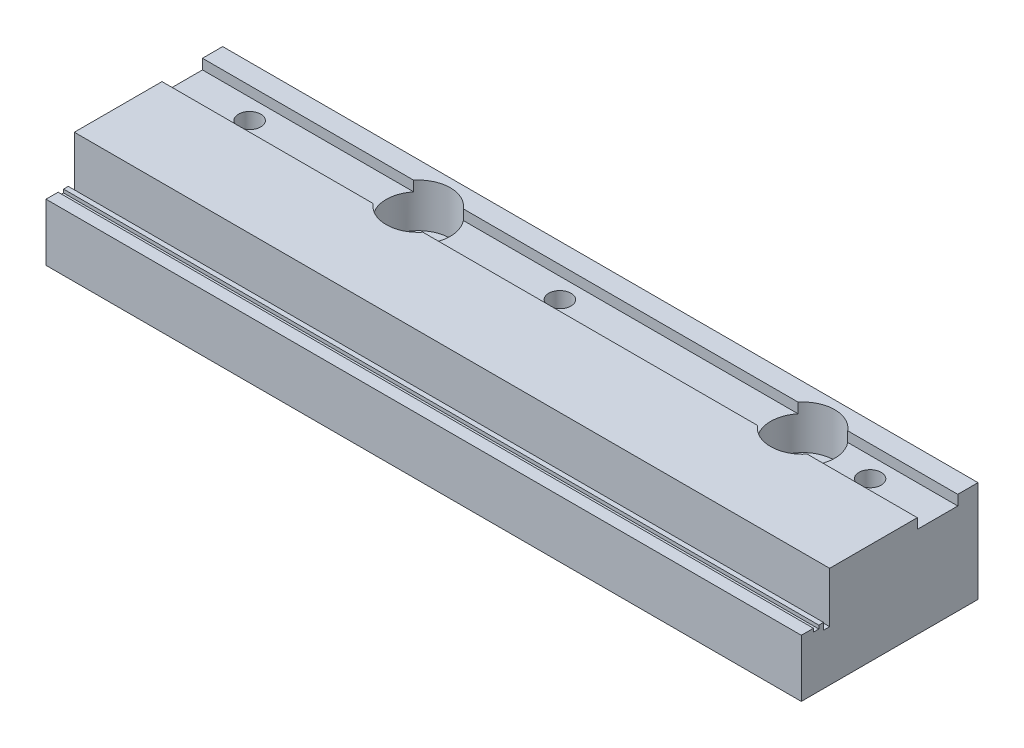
from build123d import *

# Parameters (mm, degrees)
SKETCH_1_W          = 112
SKETCH_1_H          = 15
EXTRUDE_1_DEPTH     = 26.2
SKETCH_2_OUTSIDE_W  = 51.4
SKETCH_2_OUTSIDE_H  = 40.2
CUT_EXTRUDE_1_DEPTH = 116.997586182
SKETCH_3_R          = 2.75
SKETCH_3_R_2        = 1.65
CUT_EXTRUDE_2_DEPTH = 26.2
SKETCH_5_R          = 4.75
CUT_EXTRUDE_3_DEPTH = 6.5


with BuildPart() as part:
    # Sketch 1 → Extrude 1 (new body)
    with BuildSketch(Plane.XY):
        with Locations((56, 7.5)):
            Rectangle(SKETCH_1_W, SKETCH_1_H)
    extrude(amount=EXTRUDE_1_DEPTH)

    # Sketch 2 outside → Cut-Extrude 1 (cut, through all)
    with BuildSketch(Plane(origin=(112, 0, 0), x_dir=(0, 0, -1), z_dir=(1, 0, 0))):
        with Locations((-13.1, 7.5)):
            Rectangle(SKETCH_2_OUTSIDE_W, SKETCH_2_OUTSIDE_H)
        Polygon((-26.2, 0), (-26.2, 8.5), (-24.4, 8.5), (-24.4, 8), (-23.6, 8), (-23.6, 8.5), (-22.9, 8.5), (-22.9, 7.5), (-22, 7.5), (-22, 15), (-9, 15), (-9, 13.5), (-3, 13.5), (-3, 15), (0, 15), (0, 0), align=None, mode=Mode.SUBTRACT)
    extrude(amount=-CUT_EXTRUDE_1_DEPTH, mode=Mode.SUBTRACT)

    # Sketch 3 → Cut-Extrude 2 (cut)
    with BuildSketch(Plane(origin=(0, 13.5, 0), x_dir=(1, 0, 0), z_dir=(0, 1, 0))):
        with Locations(Location((35, -6, 0), (0, 0, 270))):
            Circle(SKETCH_3_R)
        with Locations(Location((92, -6, 0), (0, 0, 270))):
            Circle(SKETCH_3_R)
        with Locations(Location((10, -6, 0), (0, 0, 270))):
            Circle(SKETCH_3_R_2)
        with Locations(Location((56, -6, 0), (0, 0, 270))):
            Circle(SKETCH_3_R_2)
        with Locations(Location((102, -6, 0), (0, 0, 270))):
            Circle(SKETCH_3_R_2)
    extrude(amount=-CUT_EXTRUDE_2_DEPTH, mode=Mode.SUBTRACT)

    # Sketch 5 → Cut-Extrude 3 (cut)
    with BuildSketch(Plane(origin=(0, 15, 0), x_dir=(1, 0, 0), z_dir=(0, 1, 0))):
        with Locations(Location((35, -6, 0), (0, 0, 270))):
            Circle(SKETCH_5_R)
        with Locations(Location((92, -6, 0), (0, 0, 270))):
            Circle(SKETCH_5_R)
    extrude(amount=-CUT_EXTRUDE_3_DEPTH, mode=Mode.SUBTRACT)


solid = part.part
